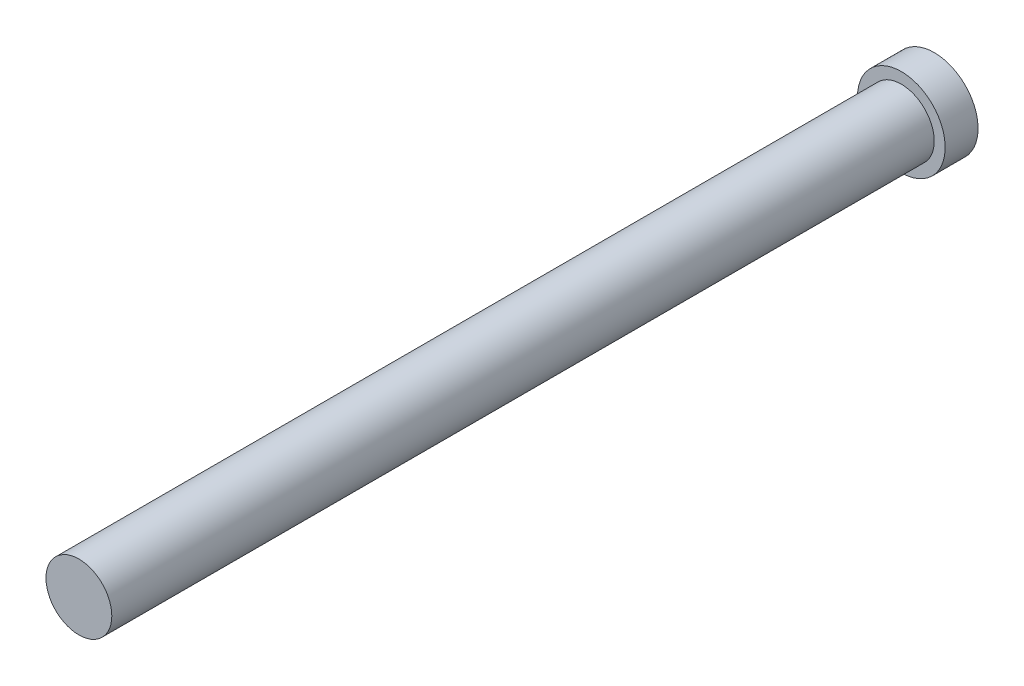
ISO-10303-21;
HEADER;
FILE_DESCRIPTION(('STEP AP214'),'2;1');
FILE_NAME('part.step','',(''),(''),'','','');
FILE_SCHEMA(('AUTOMOTIVE_DESIGN { 1 0 10303 214 1 1 1 1 }'));
ENDSEC;
DATA;
#1=APPLICATION_CONTEXT('core data for automotive mechanical design processes');
#2=APPLICATION_PROTOCOL_DEFINITION('international standard','automotive_design',2000,#1);
#3=PRODUCT_CONTEXT('',#1,'mechanical');
#4=PRODUCT('Part','Part','',(#3));
#5=PRODUCT_RELATED_PRODUCT_CATEGORY('part','',(#4));
#6=PRODUCT_DEFINITION_FORMATION('','',#4);
#7=PRODUCT_DEFINITION_CONTEXT('part definition',#1,'design');
#8=PRODUCT_DEFINITION('design','',#6,#7);
#9=PRODUCT_DEFINITION_SHAPE('','',#8);
#10=(LENGTH_UNIT() NAMED_UNIT(*) SI_UNIT(.MILLI.,.METRE.));
#11=(NAMED_UNIT(*) PLANE_ANGLE_UNIT() SI_UNIT($,.RADIAN.));
#12=(NAMED_UNIT(*) SI_UNIT($,.STERADIAN.) SOLID_ANGLE_UNIT());
#13=UNCERTAINTY_MEASURE_WITH_UNIT(LENGTH_MEASURE(1.E-05),#10,'distance_accuracy_value','');
#14=(GEOMETRIC_REPRESENTATION_CONTEXT(3) GLOBAL_UNCERTAINTY_ASSIGNED_CONTEXT((#13)) GLOBAL_UNIT_ASSIGNED_CONTEXT((#10,
#11,#12)) REPRESENTATION_CONTEXT('',''));
#15=CARTESIAN_POINT('',(0.,0.,0.));
#16=DIRECTION('',(0.,0.,1.));
#17=DIRECTION('',(1.,0.,0.));
#18=AXIS2_PLACEMENT_3D('',#15,#16,#17);
#19=CARTESIAN_POINT('',(0.,0.,37.5));
#20=DIRECTION('',(0.,0.,-1.));
#21=DIRECTION('',(-1.,0.,0.));
#22=AXIS2_PLACEMENT_3D('',#19,#20,#21);
#23=CYLINDRICAL_SURFACE('',#22,1.5);
#24=CARTESIAN_POINT('',(0.,0.,37.5));
#25=DIRECTION('',(0.,0.,1.));
#26=DIRECTION('',(1.,0.,0.));
#27=AXIS2_PLACEMENT_3D('',#24,#25,#26);
#28=CIRCLE('',#27,1.5);
#29=CARTESIAN_POINT('',(1.5,0.,37.5));
#30=VERTEX_POINT('',#29);
#31=EDGE_CURVE('E11',#30,#30,#28,.T.);
#32=ORIENTED_EDGE('',*,*,#31,.F.);
#33=EDGE_LOOP('',(#32));
#34=FACE_BOUND('',#33,.T.);
#35=CARTESIAN_POINT('',(0.,0.,0.));
#36=DIRECTION('',(0.,0.,-1.));
#37=DIRECTION('',(-1.,0.,0.));
#38=AXIS2_PLACEMENT_3D('',#35,#36,#37);
#39=CIRCLE('',#38,1.5);
#40=CARTESIAN_POINT('',(-1.5,0.,0.));
#41=VERTEX_POINT('',#40);
#42=EDGE_CURVE('E40',#41,#41,#39,.T.);
#43=ORIENTED_EDGE('',*,*,#42,.F.);
#44=EDGE_LOOP('',(#43));
#45=FACE_BOUND('',#44,.T.);
#46=ADVANCED_FACE('F33',(#34,#45),#23,.T.);
#47=CARTESIAN_POINT('',(0.,0.,37.5));
#48=DIRECTION('',(0.,0.,1.));
#49=DIRECTION('',(1.,0.,0.));
#50=AXIS2_PLACEMENT_3D('',#47,#48,#49);
#51=PLANE('',#50);
#52=ORIENTED_EDGE('',*,*,#31,.T.);
#53=EDGE_LOOP('',(#52));
#54=FACE_BOUND('',#53,.T.);
#55=ADVANCED_FACE('F216',(#54),#51,.T.);
#56=CARTESIAN_POINT('',(0.,0.,0.));
#57=DIRECTION('',(0.,0.,-1.));
#58=DIRECTION('',(-1.,0.,0.));
#59=AXIS2_PLACEMENT_3D('',#56,#57,#58);
#60=PLANE('',#59);
#61=CARTESIAN_POINT('',(0.,0.,0.));
#62=DIRECTION('',(0.,0.,-1.));
#63=DIRECTION('',(-1.,0.,0.));
#64=AXIS2_PLACEMENT_3D('',#61,#62,#63);
#65=CIRCLE('',#64,2.);
#66=CARTESIAN_POINT('',(-2.,0.,0.));
#67=VERTEX_POINT('',#66);
#68=EDGE_CURVE('E188',#67,#67,#65,.T.);
#69=ORIENTED_EDGE('',*,*,#68,.F.);
#70=EDGE_LOOP('',(#69));
#71=FACE_BOUND('',#70,.T.);
#72=ORIENTED_EDGE('',*,*,#42,.T.);
#73=EDGE_LOOP('',(#72));
#74=FACE_BOUND('',#73,.T.);
#75=ADVANCED_FACE('F213',(#71,#74),#60,.F.);
#76=CARTESIAN_POINT('',(0.,0.,-1.5));
#77=DIRECTION('',(0.,0.,1.));
#78=DIRECTION('',(1.,0.,0.));
#79=AXIS2_PLACEMENT_3D('',#76,#77,#78);
#80=CYLINDRICAL_SURFACE('',#79,2.);
#81=CARTESIAN_POINT('',(0.,0.,-1.5));
#82=DIRECTION('',(0.,0.,-1.));
#83=DIRECTION('',(-1.,0.,0.));
#84=AXIS2_PLACEMENT_3D('',#81,#82,#83);
#85=CIRCLE('',#84,2.);
#86=CARTESIAN_POINT('',(-2.,0.,-1.5));
#87=VERTEX_POINT('',#86);
#88=EDGE_CURVE('E206',#87,#87,#85,.T.);
#89=ORIENTED_EDGE('',*,*,#88,.F.);
#90=EDGE_LOOP('',(#89));
#91=FACE_BOUND('',#90,.T.);
#92=ORIENTED_EDGE('',*,*,#68,.T.);
#93=EDGE_LOOP('',(#92));
#94=FACE_BOUND('',#93,.T.);
#95=ADVANCED_FACE('F226',(#91,#94),#80,.T.);
#96=CARTESIAN_POINT('',(0.,0.,-1.5));
#97=DIRECTION('',(0.,0.,-1.));
#98=DIRECTION('',(-1.,0.,0.));
#99=AXIS2_PLACEMENT_3D('',#96,#97,#98);
#100=PLANE('',#99);
#101=DIRECTION('',(0.,-1.,0.));
#102=VECTOR('',#101,1.);
#103=CARTESIAN_POINT('',(1.73567977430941,-0.304992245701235,-1.5));
#104=LINE('',#103,#102);
#105=CARTESIAN_POINT('',(1.73567977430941,0.304992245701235,-1.5));
#106=VERTEX_POINT('',#105);
#107=CARTESIAN_POINT('',(1.73567977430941,-0.304992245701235,-1.5));
#108=VERTEX_POINT('',#107);
#109=EDGE_CURVE('E47',#106,#108,#104,.T.);
#110=ORIENTED_EDGE('',*,*,#109,.F.);
#111=DIRECTION('',(1.,0.,0.));
#112=VECTOR('',#111,1.);
#113=CARTESIAN_POINT('',(0.296795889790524,0.304992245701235,-1.5));
#114=LINE('',#113,#112);
#115=CARTESIAN_POINT('',(0.296795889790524,0.304992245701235,-1.5));
#116=VERTEX_POINT('',#115);
#117=EDGE_CURVE('E184',#116,#106,#114,.T.);
#118=ORIENTED_EDGE('',*,*,#117,.F.);
#119=DIRECTION('',(0.,-1.,0.));
#120=VECTOR('',#119,1.);
#121=CARTESIAN_POINT('',(0.296795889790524,0.304992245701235,-1.5));
#122=LINE('',#121,#120);
#123=CARTESIAN_POINT('',(0.296795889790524,1.68903514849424,-1.5));
#124=VERTEX_POINT('',#123);
#125=EDGE_CURVE('E182',#124,#116,#122,.T.);
#126=ORIENTED_EDGE('',*,*,#125,.F.);
#127=DIRECTION('',(1.,0.,0.));
#128=VECTOR('',#127,1.);
#129=CARTESIAN_POINT('',(-0.296795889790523,1.68903514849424,-1.5));
#130=LINE('',#129,#128);
#131=CARTESIAN_POINT('',(-0.296795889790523,1.68903514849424,-1.5));
#132=VERTEX_POINT('',#131);
#133=EDGE_CURVE('E131',#132,#124,#130,.T.);
#134=ORIENTED_EDGE('',*,*,#133,.F.);
#135=DIRECTION('',(0.,1.,0.));
#136=VECTOR('',#135,1.);
#137=CARTESIAN_POINT('',(-0.296795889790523,0.304992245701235,-1.5));
#138=LINE('',#137,#136);
#139=CARTESIAN_POINT('',(-0.296795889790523,0.304992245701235,-1.5));
#140=VERTEX_POINT('',#139);
#141=EDGE_CURVE('E178',#140,#132,#138,.T.);
#142=ORIENTED_EDGE('',*,*,#141,.F.);
#143=DIRECTION('',(1.,0.,0.));
#144=VECTOR('',#143,1.);
#145=CARTESIAN_POINT('',(-1.73567977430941,0.304992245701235,-1.5));
#146=LINE('',#145,#144);
#147=CARTESIAN_POINT('',(-1.73567977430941,0.304992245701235,-1.5));
#148=VERTEX_POINT('',#147);
#149=EDGE_CURVE('E175',#148,#140,#146,.T.);
#150=ORIENTED_EDGE('',*,*,#149,.F.);
#151=DIRECTION('',(0.,1.,0.));
#152=VECTOR('',#151,1.);
#153=CARTESIAN_POINT('',(-1.73567977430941,-0.304992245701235,-1.5));
#154=LINE('',#153,#152);
#155=CARTESIAN_POINT('',(-1.73567977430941,-0.304992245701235,-1.5));
#156=VERTEX_POINT('',#155);
#157=EDGE_CURVE('E172',#156,#148,#154,.T.);
#158=ORIENTED_EDGE('',*,*,#157,.F.);
#159=DIRECTION('',(-1.,0.,0.));
#160=VECTOR('',#159,1.);
#161=CARTESIAN_POINT('',(-1.73567977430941,-0.304992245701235,-1.5));
#162=LINE('',#161,#160);
#163=CARTESIAN_POINT('',(-0.296795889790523,-0.304992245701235,-1.5));
#164=VERTEX_POINT('',#163);
#165=EDGE_CURVE('E169',#164,#156,#162,.T.);
#166=ORIENTED_EDGE('',*,*,#165,.F.);
#167=DIRECTION('',(0.,1.,0.));
#168=VECTOR('',#167,1.);
#169=CARTESIAN_POINT('',(-0.296795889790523,-1.68903514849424,-1.5));
#170=LINE('',#169,#168);
#171=CARTESIAN_POINT('',(-0.296795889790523,-1.68903514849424,-1.5));
#172=VERTEX_POINT('',#171);
#173=EDGE_CURVE('E166',#172,#164,#170,.T.);
#174=ORIENTED_EDGE('',*,*,#173,.F.);
#175=DIRECTION('',(-1.,0.,0.));
#176=VECTOR('',#175,1.);
#177=CARTESIAN_POINT('',(-0.296795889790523,-1.68903514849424,-1.5));
#178=LINE('',#177,#176);
#179=CARTESIAN_POINT('',(0.296795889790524,-1.68903514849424,-1.5));
#180=VERTEX_POINT('',#179);
#181=EDGE_CURVE('E163',#180,#172,#178,.T.);
#182=ORIENTED_EDGE('',*,*,#181,.F.);
#183=DIRECTION('',(0.,-1.,0.));
#184=VECTOR('',#183,1.);
#185=CARTESIAN_POINT('',(0.296795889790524,-1.68903514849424,-1.5));
#186=LINE('',#185,#184);
#187=CARTESIAN_POINT('',(0.296795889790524,-0.304992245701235,-1.5));
#188=VERTEX_POINT('',#187);
#189=EDGE_CURVE('E160',#188,#180,#186,.T.);
#190=ORIENTED_EDGE('',*,*,#189,.F.);
#191=DIRECTION('',(-1.,0.,0.));
#192=VECTOR('',#191,1.);
#193=CARTESIAN_POINT('',(0.296795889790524,-0.304992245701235,-1.5));
#194=LINE('',#193,#192);
#195=EDGE_CURVE('E157',#108,#188,#194,.T.);
#196=ORIENTED_EDGE('',*,*,#195,.F.);
#197=EDGE_LOOP('',(#110,#118,#126,#134,#142,#150,#158,#166,#174,#182,#190,#196));
#198=FACE_BOUND('',#197,.T.);
#199=ORIENTED_EDGE('',*,*,#88,.T.);
#200=EDGE_LOOP('',(#199));
#201=FACE_BOUND('',#200,.T.);
#202=ADVANCED_FACE('F231',(#198,#201),#100,.T.);
#203=CARTESIAN_POINT('',(1.73567977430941,-0.304992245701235,-0.5));
#204=DIRECTION('',(1.,0.,0.));
#205=DIRECTION('',(0.,0.,-1.));
#206=AXIS2_PLACEMENT_3D('',#203,#204,#205);
#207=PLANE('',#206);
#208=ORIENTED_EDGE('',*,*,#109,.T.);
#209=DIRECTION('',(0.,0.,-1.));
#210=VECTOR('',#209,1.);
#211=CARTESIAN_POINT('',(1.73567977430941,-0.304992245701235,-0.5));
#212=LINE('',#211,#210);
#213=CARTESIAN_POINT('',(1.73567977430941,-0.304992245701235,-0.5));
#214=VERTEX_POINT('',#213);
#215=EDGE_CURVE('E95',#214,#108,#212,.T.);
#216=ORIENTED_EDGE('',*,*,#215,.F.);
#217=DIRECTION('',(0.,-1.,0.));
#218=VECTOR('',#217,1.);
#219=CARTESIAN_POINT('',(1.73567977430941,-0.304992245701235,-0.5));
#220=LINE('',#219,#218);
#221=CARTESIAN_POINT('',(1.73567977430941,0.304992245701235,-0.5));
#222=VERTEX_POINT('',#221);
#223=EDGE_CURVE('E186',#222,#214,#220,.T.);
#224=ORIENTED_EDGE('',*,*,#223,.F.);
#225=DIRECTION('',(0.,0.,-1.));
#226=VECTOR('',#225,1.);
#227=CARTESIAN_POINT('',(1.73567977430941,0.304992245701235,-0.5));
#228=LINE('',#227,#226);
#229=EDGE_CURVE('E55',#222,#106,#228,.T.);
#230=ORIENTED_EDGE('',*,*,#229,.T.);
#231=EDGE_LOOP('',(#208,#216,#224,#230));
#232=FACE_BOUND('',#231,.T.);
#233=ADVANCED_FACE('F236',(#232),#207,.F.);
#234=CARTESIAN_POINT('',(0.296795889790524,0.304992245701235,-0.5));
#235=DIRECTION('',(0.,1.,0.));
#236=DIRECTION('',(-1.,0.,0.));
#237=AXIS2_PLACEMENT_3D('',#234,#235,#236);
#238=PLANE('',#237);
#239=ORIENTED_EDGE('',*,*,#117,.T.);
#240=ORIENTED_EDGE('',*,*,#229,.F.);
#241=DIRECTION('',(1.,0.,0.));
#242=VECTOR('',#241,1.);
#243=CARTESIAN_POINT('',(0.296795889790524,0.304992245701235,-0.5));
#244=LINE('',#243,#242);
#245=CARTESIAN_POINT('',(0.296795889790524,0.304992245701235,-0.5));
#246=VERTEX_POINT('',#245);
#247=EDGE_CURVE('E143',#246,#222,#244,.T.);
#248=ORIENTED_EDGE('',*,*,#247,.F.);
#249=DIRECTION('',(0.,0.,-1.));
#250=VECTOR('',#249,1.);
#251=CARTESIAN_POINT('',(0.296795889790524,0.304992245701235,-0.5));
#252=LINE('',#251,#250);
#253=EDGE_CURVE('E135',#246,#116,#252,.T.);
#254=ORIENTED_EDGE('',*,*,#253,.T.);
#255=EDGE_LOOP('',(#239,#240,#248,#254));
#256=FACE_BOUND('',#255,.T.);
#257=ADVANCED_FACE('F240',(#256),#238,.F.);
#258=CARTESIAN_POINT('',(0.296795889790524,0.304992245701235,-0.5));
#259=DIRECTION('',(1.,0.,0.));
#260=DIRECTION('',(0.,1.,0.));
#261=AXIS2_PLACEMENT_3D('',#258,#259,#260);
#262=PLANE('',#261);
#263=ORIENTED_EDGE('',*,*,#125,.T.);
#264=ORIENTED_EDGE('',*,*,#253,.F.);
#265=DIRECTION('',(0.,-1.,0.));
#266=VECTOR('',#265,1.);
#267=CARTESIAN_POINT('',(0.296795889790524,0.304992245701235,-0.5));
#268=LINE('',#267,#266);
#269=CARTESIAN_POINT('',(0.296795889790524,1.68903514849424,-0.5));
#270=VERTEX_POINT('',#269);
#271=EDGE_CURVE('E139',#270,#246,#268,.T.);
#272=ORIENTED_EDGE('',*,*,#271,.F.);
#273=DIRECTION('',(0.,0.,-1.));
#274=VECTOR('',#273,1.);
#275=CARTESIAN_POINT('',(0.296795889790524,1.68903514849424,-0.5));
#276=LINE('',#275,#274);
#277=EDGE_CURVE('E124',#270,#124,#276,.T.);
#278=ORIENTED_EDGE('',*,*,#277,.T.);
#279=EDGE_LOOP('',(#263,#264,#272,#278));
#280=FACE_BOUND('',#279,.T.);
#281=ADVANCED_FACE('F140',(#280),#262,.F.);
#282=CARTESIAN_POINT('',(-0.296795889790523,1.68903514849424,-0.5));
#283=DIRECTION('',(0.,1.,0.));
#284=DIRECTION('',(0.,0.,1.));
#285=AXIS2_PLACEMENT_3D('',#282,#283,#284);
#286=PLANE('',#285);
#287=ORIENTED_EDGE('',*,*,#133,.T.);
#288=ORIENTED_EDGE('',*,*,#277,.F.);
#289=DIRECTION('',(1.,0.,0.));
#290=VECTOR('',#289,1.);
#291=CARTESIAN_POINT('',(-0.296795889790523,1.68903514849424,-0.5));
#292=LINE('',#291,#290);
#293=CARTESIAN_POINT('',(-0.296795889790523,1.68903514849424,-0.5));
#294=VERTEX_POINT('',#293);
#295=EDGE_CURVE('E128',#294,#270,#292,.T.);
#296=ORIENTED_EDGE('',*,*,#295,.F.);
#297=DIRECTION('',(0.,0.,-1.));
#298=VECTOR('',#297,1.);
#299=CARTESIAN_POINT('',(-0.296795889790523,1.68903514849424,-0.5));
#300=LINE('',#299,#298);
#301=EDGE_CURVE('E136',#294,#132,#300,.T.);
#302=ORIENTED_EDGE('',*,*,#301,.T.);
#303=EDGE_LOOP('',(#287,#288,#296,#302));
#304=FACE_BOUND('',#303,.T.);
#305=ADVANCED_FACE('F126',(#304),#286,.F.);
#306=CARTESIAN_POINT('',(-0.296795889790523,0.304992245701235,-0.5));
#307=DIRECTION('',(-1.,0.,0.));
#308=DIRECTION('',(0.,-1.,0.));
#309=AXIS2_PLACEMENT_3D('',#306,#307,#308);
#310=PLANE('',#309);
#311=ORIENTED_EDGE('',*,*,#141,.T.);
#312=ORIENTED_EDGE('',*,*,#301,.F.);
#313=DIRECTION('',(0.,1.,0.));
#314=VECTOR('',#313,1.);
#315=CARTESIAN_POINT('',(-0.296795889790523,0.304992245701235,-0.5));
#316=LINE('',#315,#314);
#317=CARTESIAN_POINT('',(-0.296795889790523,0.304992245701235,-0.5));
#318=VERTEX_POINT('',#317);
#319=EDGE_CURVE('E149',#318,#294,#316,.T.);
#320=ORIENTED_EDGE('',*,*,#319,.F.);
#321=DIRECTION('',(0.,0.,-1.));
#322=VECTOR('',#321,1.);
#323=CARTESIAN_POINT('',(-0.296795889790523,0.304992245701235,-0.5));
#324=LINE('',#323,#322);
#325=EDGE_CURVE('E191',#318,#140,#324,.T.);
#326=ORIENTED_EDGE('',*,*,#325,.T.);
#327=EDGE_LOOP('',(#311,#312,#320,#326));
#328=FACE_BOUND('',#327,.T.);
#329=ADVANCED_FACE('F268',(#328),#310,.F.);
#330=CARTESIAN_POINT('',(-1.73567977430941,0.304992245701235,-0.5));
#331=DIRECTION('',(0.,1.,0.));
#332=DIRECTION('',(-1.,0.,0.));
#333=AXIS2_PLACEMENT_3D('',#330,#331,#332);
#334=PLANE('',#333);
#335=ORIENTED_EDGE('',*,*,#149,.T.);
#336=ORIENTED_EDGE('',*,*,#325,.F.);
#337=DIRECTION('',(1.,0.,0.));
#338=VECTOR('',#337,1.);
#339=CARTESIAN_POINT('',(-1.73567977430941,0.304992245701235,-0.5));
#340=LINE('',#339,#338);
#341=CARTESIAN_POINT('',(-1.73567977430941,0.304992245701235,-0.5));
#342=VERTEX_POINT('',#341);
#343=EDGE_CURVE('E151',#342,#318,#340,.T.);
#344=ORIENTED_EDGE('',*,*,#343,.F.);
#345=DIRECTION('',(0.,0.,-1.));
#346=VECTOR('',#345,1.);
#347=CARTESIAN_POINT('',(-1.73567977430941,0.304992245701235,-0.5));
#348=LINE('',#347,#346);
#349=EDGE_CURVE('E193',#342,#148,#348,.T.);
#350=ORIENTED_EDGE('',*,*,#349,.T.);
#351=EDGE_LOOP('',(#335,#336,#344,#350));
#352=FACE_BOUND('',#351,.T.);
#353=ADVANCED_FACE('F264',(#352),#334,.F.);
#354=CARTESIAN_POINT('',(-1.73567977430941,-0.304992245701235,-0.5));
#355=DIRECTION('',(-1.,0.,0.));
#356=DIRECTION('',(0.,0.,1.));
#357=AXIS2_PLACEMENT_3D('',#354,#355,#356);
#358=PLANE('',#357);
#359=ORIENTED_EDGE('',*,*,#157,.T.);
#360=ORIENTED_EDGE('',*,*,#349,.F.);
#361=DIRECTION('',(0.,1.,0.));
#362=VECTOR('',#361,1.);
#363=CARTESIAN_POINT('',(-1.73567977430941,-0.304992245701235,-0.5));
#364=LINE('',#363,#362);
#365=CARTESIAN_POINT('',(-1.73567977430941,-0.304992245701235,-0.5));
#366=VERTEX_POINT('',#365);
#367=EDGE_CURVE('E407',#366,#342,#364,.T.);
#368=ORIENTED_EDGE('',*,*,#367,.F.);
#369=DIRECTION('',(0.,0.,-1.));
#370=VECTOR('',#369,1.);
#371=CARTESIAN_POINT('',(-1.73567977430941,-0.304992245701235,-0.5));
#372=LINE('',#371,#370);
#373=EDGE_CURVE('E195',#366,#156,#372,.T.);
#374=ORIENTED_EDGE('',*,*,#373,.T.);
#375=EDGE_LOOP('',(#359,#360,#368,#374));
#376=FACE_BOUND('',#375,.T.);
#377=ADVANCED_FACE('F260',(#376),#358,.F.);
#378=CARTESIAN_POINT('',(-1.73567977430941,-0.304992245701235,-0.5));
#379=DIRECTION('',(0.,-1.,0.));
#380=DIRECTION('',(1.,0.,0.));
#381=AXIS2_PLACEMENT_3D('',#378,#379,#380);
#382=PLANE('',#381);
#383=ORIENTED_EDGE('',*,*,#165,.T.);
#384=ORIENTED_EDGE('',*,*,#373,.F.);
#385=DIRECTION('',(-1.,0.,0.));
#386=VECTOR('',#385,1.);
#387=CARTESIAN_POINT('',(-1.73567977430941,-0.304992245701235,-0.5));
#388=LINE('',#387,#386);
#389=CARTESIAN_POINT('',(-0.296795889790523,-0.304992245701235,-0.5));
#390=VERTEX_POINT('',#389);
#391=EDGE_CURVE('E404',#390,#366,#388,.T.);
#392=ORIENTED_EDGE('',*,*,#391,.F.);
#393=DIRECTION('',(0.,0.,-1.));
#394=VECTOR('',#393,1.);
#395=CARTESIAN_POINT('',(-0.296795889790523,-0.304992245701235,-0.5));
#396=LINE('',#395,#394);
#397=EDGE_CURVE('E197',#390,#164,#396,.T.);
#398=ORIENTED_EDGE('',*,*,#397,.T.);
#399=EDGE_LOOP('',(#383,#384,#392,#398));
#400=FACE_BOUND('',#399,.T.);
#401=ADVANCED_FACE('F256',(#400),#382,.F.);
#402=CARTESIAN_POINT('',(-0.296795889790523,-1.68903514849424,-0.5));
#403=DIRECTION('',(-1.,0.,0.));
#404=DIRECTION('',(0.,-1.,0.));
#405=AXIS2_PLACEMENT_3D('',#402,#403,#404);
#406=PLANE('',#405);
#407=ORIENTED_EDGE('',*,*,#173,.T.);
#408=ORIENTED_EDGE('',*,*,#397,.F.);
#409=DIRECTION('',(0.,1.,0.));
#410=VECTOR('',#409,1.);
#411=CARTESIAN_POINT('',(-0.296795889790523,-1.68903514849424,-0.5));
#412=LINE('',#411,#410);
#413=CARTESIAN_POINT('',(-0.296795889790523,-1.68903514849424,-0.5));
#414=VERTEX_POINT('',#413);
#415=EDGE_CURVE('E401',#414,#390,#412,.T.);
#416=ORIENTED_EDGE('',*,*,#415,.F.);
#417=DIRECTION('',(0.,0.,-1.));
#418=VECTOR('',#417,1.);
#419=CARTESIAN_POINT('',(-0.296795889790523,-1.68903514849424,-0.5));
#420=LINE('',#419,#418);
#421=EDGE_CURVE('E199',#414,#172,#420,.T.);
#422=ORIENTED_EDGE('',*,*,#421,.T.);
#423=EDGE_LOOP('',(#407,#408,#416,#422));
#424=FACE_BOUND('',#423,.T.);
#425=ADVANCED_FACE('F252',(#424),#406,.F.);
#426=CARTESIAN_POINT('',(-0.296795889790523,-1.68903514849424,-0.5));
#427=DIRECTION('',(0.,-1.,0.));
#428=DIRECTION('',(0.,0.,-1.));
#429=AXIS2_PLACEMENT_3D('',#426,#427,#428);
#430=PLANE('',#429);
#431=ORIENTED_EDGE('',*,*,#181,.T.);
#432=ORIENTED_EDGE('',*,*,#421,.F.);
#433=DIRECTION('',(-1.,0.,0.));
#434=VECTOR('',#433,1.);
#435=CARTESIAN_POINT('',(-0.296795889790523,-1.68903514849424,-0.5));
#436=LINE('',#435,#434);
#437=CARTESIAN_POINT('',(0.296795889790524,-1.68903514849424,-0.5));
#438=VERTEX_POINT('',#437);
#439=EDGE_CURVE('E398',#438,#414,#436,.T.);
#440=ORIENTED_EDGE('',*,*,#439,.F.);
#441=DIRECTION('',(0.,0.,-1.));
#442=VECTOR('',#441,1.);
#443=CARTESIAN_POINT('',(0.296795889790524,-1.68903514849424,-0.5));
#444=LINE('',#443,#442);
#445=EDGE_CURVE('E201',#438,#180,#444,.T.);
#446=ORIENTED_EDGE('',*,*,#445,.T.);
#447=EDGE_LOOP('',(#431,#432,#440,#446));
#448=FACE_BOUND('',#447,.T.);
#449=ADVANCED_FACE('F248',(#448),#430,.F.);
#450=CARTESIAN_POINT('',(0.296795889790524,-1.68903514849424,-0.5));
#451=DIRECTION('',(1.,0.,0.));
#452=DIRECTION('',(0.,1.,0.));
#453=AXIS2_PLACEMENT_3D('',#450,#451,#452);
#454=PLANE('',#453);
#455=ORIENTED_EDGE('',*,*,#189,.T.);
#456=ORIENTED_EDGE('',*,*,#445,.F.);
#457=DIRECTION('',(0.,-1.,0.));
#458=VECTOR('',#457,1.);
#459=CARTESIAN_POINT('',(0.296795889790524,-1.68903514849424,-0.5));
#460=LINE('',#459,#458);
#461=CARTESIAN_POINT('',(0.296795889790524,-0.304992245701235,-0.5));
#462=VERTEX_POINT('',#461);
#463=EDGE_CURVE('E393',#462,#438,#460,.T.);
#464=ORIENTED_EDGE('',*,*,#463,.F.);
#465=DIRECTION('',(0.,0.,-1.));
#466=VECTOR('',#465,1.);
#467=CARTESIAN_POINT('',(0.296795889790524,-0.304992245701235,-0.5));
#468=LINE('',#467,#466);
#469=EDGE_CURVE('E203',#462,#188,#468,.T.);
#470=ORIENTED_EDGE('',*,*,#469,.T.);
#471=EDGE_LOOP('',(#455,#456,#464,#470));
#472=FACE_BOUND('',#471,.T.);
#473=ADVANCED_FACE('F244',(#472),#454,.F.);
#474=CARTESIAN_POINT('',(0.296795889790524,-0.304992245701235,-0.5));
#475=DIRECTION('',(0.,-1.,0.));
#476=DIRECTION('',(1.,0.,0.));
#477=AXIS2_PLACEMENT_3D('',#474,#475,#476);
#478=PLANE('',#477);
#479=ORIENTED_EDGE('',*,*,#195,.T.);
#480=ORIENTED_EDGE('',*,*,#469,.F.);
#481=DIRECTION('',(-1.,0.,0.));
#482=VECTOR('',#481,1.);
#483=CARTESIAN_POINT('',(0.296795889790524,-0.304992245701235,-0.5));
#484=LINE('',#483,#482);
#485=EDGE_CURVE('E391',#214,#462,#484,.T.);
#486=ORIENTED_EDGE('',*,*,#485,.F.);
#487=ORIENTED_EDGE('',*,*,#215,.T.);
#488=EDGE_LOOP('',(#479,#480,#486,#487));
#489=FACE_BOUND('',#488,.T.);
#490=ADVANCED_FACE('F241',(#489),#478,.F.);
#491=CARTESIAN_POINT('',(0.,0.,-0.5));
#492=DIRECTION('',(0.,0.,-1.));
#493=DIRECTION('',(-1.,0.,0.));
#494=AXIS2_PLACEMENT_3D('',#491,#492,#493);
#495=PLANE('',#494);
#496=ORIENTED_EDGE('',*,*,#223,.T.);
#497=ORIENTED_EDGE('',*,*,#485,.T.);
#498=ORIENTED_EDGE('',*,*,#463,.T.);
#499=ORIENTED_EDGE('',*,*,#439,.T.);
#500=ORIENTED_EDGE('',*,*,#415,.T.);
#501=ORIENTED_EDGE('',*,*,#391,.T.);
#502=ORIENTED_EDGE('',*,*,#367,.T.);
#503=ORIENTED_EDGE('',*,*,#343,.T.);
#504=ORIENTED_EDGE('',*,*,#319,.T.);
#505=ORIENTED_EDGE('',*,*,#295,.T.);
#506=ORIENTED_EDGE('',*,*,#271,.T.);
#507=ORIENTED_EDGE('',*,*,#247,.T.);
#508=EDGE_LOOP('',(#496,#497,#498,#499,#500,#501,#502,#503,#504,#505,#506,#507));
#509=FACE_BOUND('',#508,.T.);
#510=ADVANCED_FACE('F146',(#509),#495,.T.);
#511=CLOSED_SHELL('',(#46,#55,#75,#95,#202,#233,#257,#281,#305,#329,#353,#377,#401,#425,#449,
#473,#490,#510));
#512=MANIFOLD_SOLID_BREP('B2',#511);
#513=ADVANCED_BREP_SHAPE_REPRESENTATION('',(#18,#512),#14);
#514=SHAPE_DEFINITION_REPRESENTATION(#9,#513);
ENDSEC;
END-ISO-10303-21;
